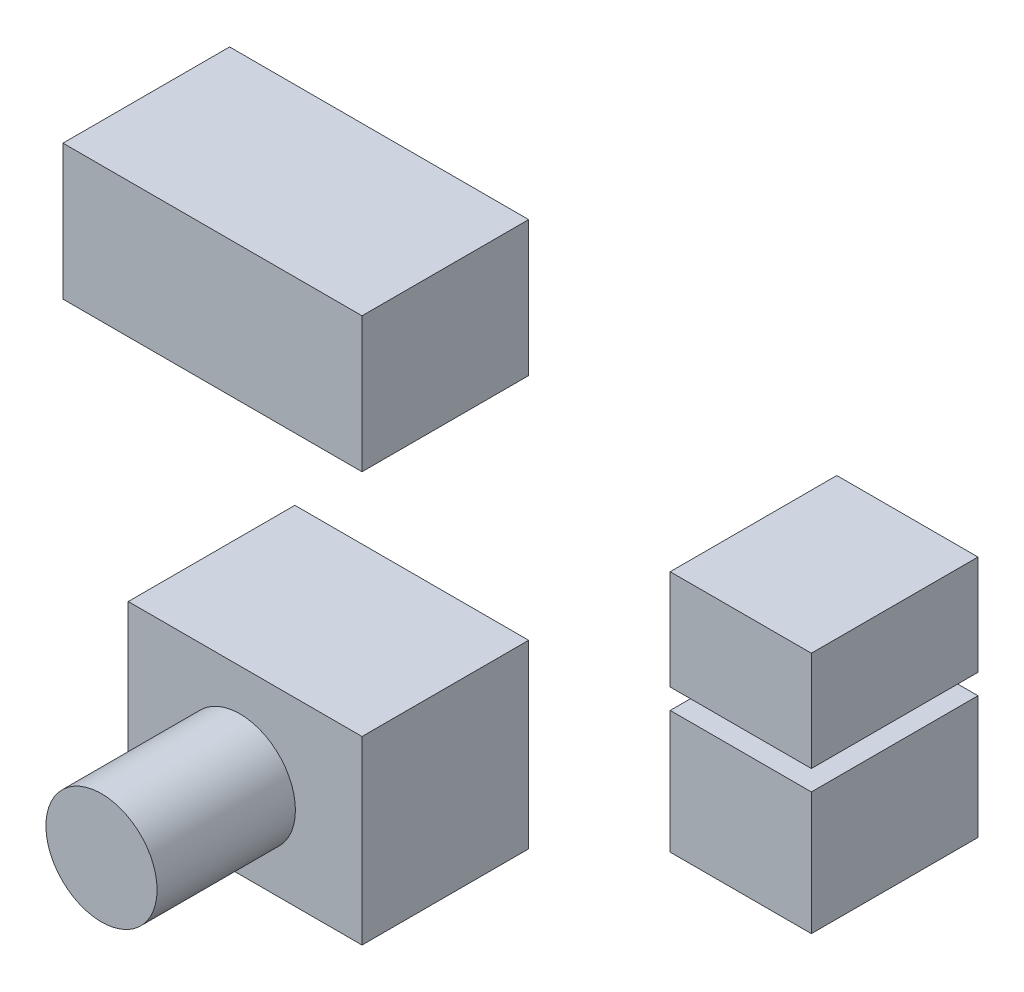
ISO-10303-21;
HEADER;
FILE_DESCRIPTION(('STEP AP214'),'2;1');
FILE_NAME('part.step','',(''),(''),'','','');
FILE_SCHEMA(('AUTOMOTIVE_DESIGN { 1 0 10303 214 1 1 1 1 }'));
ENDSEC;
DATA;
#1=APPLICATION_CONTEXT('core data for automotive mechanical design processes');
#2=APPLICATION_PROTOCOL_DEFINITION('international standard','automotive_design',2000,#1);
#3=PRODUCT_CONTEXT('',#1,'mechanical');
#4=PRODUCT('Part','Part','',(#3));
#5=PRODUCT_RELATED_PRODUCT_CATEGORY('part','',(#4));
#6=PRODUCT_DEFINITION_FORMATION('','',#4);
#7=PRODUCT_DEFINITION_CONTEXT('part definition',#1,'design');
#8=PRODUCT_DEFINITION('design','',#6,#7);
#9=PRODUCT_DEFINITION_SHAPE('','',#8);
#10=(LENGTH_UNIT() NAMED_UNIT(*) SI_UNIT(.MILLI.,.METRE.));
#11=(NAMED_UNIT(*) PLANE_ANGLE_UNIT() SI_UNIT($,.RADIAN.));
#12=(NAMED_UNIT(*) SI_UNIT($,.STERADIAN.) SOLID_ANGLE_UNIT());
#13=UNCERTAINTY_MEASURE_WITH_UNIT(LENGTH_MEASURE(1.E-05),#10,'distance_accuracy_value','');
#14=(GEOMETRIC_REPRESENTATION_CONTEXT(3) GLOBAL_UNCERTAINTY_ASSIGNED_CONTEXT((#13)) GLOBAL_UNIT_ASSIGNED_CONTEXT((#10,
#11,#12)) REPRESENTATION_CONTEXT('',''));
#15=CARTESIAN_POINT('',(0.,0.,0.));
#16=DIRECTION('',(0.,0.,1.));
#17=DIRECTION('',(1.,0.,0.));
#18=AXIS2_PLACEMENT_3D('',#15,#16,#17);
#19=CARTESIAN_POINT('',(27.2263777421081,39.2452291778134,26.924));
#20=DIRECTION('',(1.,0.,0.));
#21=DIRECTION('',(0.,0.,-1.));
#22=AXIS2_PLACEMENT_3D('',#19,#20,#21);
#23=PLANE('',#22);
#24=DIRECTION('',(0.,-1.,0.));
#25=VECTOR('',#24,1.);
#26=CARTESIAN_POINT('',(27.2263777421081,39.2452291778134,0.));
#27=LINE('',#26,#25);
#28=CARTESIAN_POINT('',(27.2263777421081,39.2452291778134,0.));
#29=VERTEX_POINT('',#28);
#30=CARTESIAN_POINT('',(27.2263777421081,23.1094252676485,0.));
#31=VERTEX_POINT('',#30);
#32=EDGE_CURVE('E38',#29,#31,#27,.T.);
#33=ORIENTED_EDGE('',*,*,#32,.T.);
#34=DIRECTION('',(0.,0.,1.));
#35=VECTOR('',#34,1.);
#36=CARTESIAN_POINT('',(27.2263777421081,23.1094252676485,26.924));
#37=LINE('',#36,#35);
#38=CARTESIAN_POINT('',(27.2263777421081,23.1094252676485,26.924));
#39=VERTEX_POINT('',#38);
#40=EDGE_CURVE('E52',#31,#39,#37,.T.);
#41=ORIENTED_EDGE('',*,*,#40,.T.);
#42=DIRECTION('',(0.,-1.,0.));
#43=VECTOR('',#42,1.);
#44=CARTESIAN_POINT('',(27.2263777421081,39.2452291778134,26.924));
#45=LINE('',#44,#43);
#46=CARTESIAN_POINT('',(27.2263777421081,39.2452291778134,26.924));
#47=VERTEX_POINT('',#46);
#48=EDGE_CURVE('E86',#47,#39,#45,.T.);
#49=ORIENTED_EDGE('',*,*,#48,.F.);
#50=DIRECTION('',(0.,0.,-1.));
#51=VECTOR('',#50,1.);
#52=CARTESIAN_POINT('',(27.2263777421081,39.2452291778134,26.924));
#53=LINE('',#52,#51);
#54=EDGE_CURVE('E78',#47,#29,#53,.T.);
#55=ORIENTED_EDGE('',*,*,#54,.T.);
#56=EDGE_LOOP('',(#33,#41,#49,#55));
#57=FACE_BOUND('',#56,.T.);
#58=ADVANCED_FACE('F35',(#57),#23,.F.);
#59=CARTESIAN_POINT('',(50.0376672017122,39.2452291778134,26.924));
#60=DIRECTION('',(-1.,0.,0.));
#61=DIRECTION('',(0.,0.,1.));
#62=AXIS2_PLACEMENT_3D('',#59,#60,#61);
#63=PLANE('',#62);
#64=DIRECTION('',(0.,1.,0.));
#65=VECTOR('',#64,1.);
#66=CARTESIAN_POINT('',(50.0376672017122,39.2452291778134,26.924));
#67=LINE('',#66,#65);
#68=CARTESIAN_POINT('',(50.0376672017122,23.1094252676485,26.924));
#69=VERTEX_POINT('',#68);
#70=CARTESIAN_POINT('',(50.0376672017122,39.2452291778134,26.924));
#71=VERTEX_POINT('',#70);
#72=EDGE_CURVE('E83',#69,#71,#67,.T.);
#73=ORIENTED_EDGE('',*,*,#72,.F.);
#74=DIRECTION('',(0.,0.,-1.));
#75=VECTOR('',#74,1.);
#76=CARTESIAN_POINT('',(50.0376672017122,23.1094252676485,26.924));
#77=LINE('',#76,#75);
#78=CARTESIAN_POINT('',(50.0376672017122,23.1094252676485,0.));
#79=VERTEX_POINT('',#78);
#80=EDGE_CURVE('E71',#69,#79,#77,.T.);
#81=ORIENTED_EDGE('',*,*,#80,.T.);
#82=DIRECTION('',(0.,1.,0.));
#83=VECTOR('',#82,1.);
#84=CARTESIAN_POINT('',(50.0376672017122,39.2452291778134,0.));
#85=LINE('',#84,#83);
#86=CARTESIAN_POINT('',(50.0376672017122,39.2452291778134,0.));
#87=VERTEX_POINT('',#86);
#88=EDGE_CURVE('E77',#79,#87,#85,.T.);
#89=ORIENTED_EDGE('',*,*,#88,.T.);
#90=DIRECTION('',(0.,0.,-1.));
#91=VECTOR('',#90,1.);
#92=CARTESIAN_POINT('',(50.0376672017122,39.2452291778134,26.924));
#93=LINE('',#92,#91);
#94=EDGE_CURVE('E44',#71,#87,#93,.T.);
#95=ORIENTED_EDGE('',*,*,#94,.F.);
#96=EDGE_LOOP('',(#73,#81,#89,#95));
#97=FACE_BOUND('',#96,.T.);
#98=ADVANCED_FACE('F87',(#97),#63,.F.);
#99=CARTESIAN_POINT('',(27.2263777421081,0.,26.924));
#100=DIRECTION('',(0.,0.,1.));
#101=DIRECTION('',(1.,0.,0.));
#102=AXIS2_PLACEMENT_3D('',#99,#100,#101);
#103=PLANE('',#102);
#104=DIRECTION('',(-1.,0.,0.));
#105=VECTOR('',#104,1.);
#106=CARTESIAN_POINT('',(22.8437955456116,23.1094252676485,26.924));
#107=LINE('',#106,#105);
#108=EDGE_CURVE('E12',#69,#39,#107,.T.);
#109=ORIENTED_EDGE('',*,*,#108,.F.);
#110=ORIENTED_EDGE('',*,*,#72,.T.);
#111=DIRECTION('',(-1.,0.,0.));
#112=VECTOR('',#111,1.);
#113=CARTESIAN_POINT('',(27.2263777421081,39.2452291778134,26.924));
#114=LINE('',#113,#112);
#115=EDGE_CURVE('E90',#71,#47,#114,.T.);
#116=ORIENTED_EDGE('',*,*,#115,.T.);
#117=ORIENTED_EDGE('',*,*,#48,.T.);
#118=EDGE_LOOP('',(#109,#110,#116,#117));
#119=FACE_BOUND('',#118,.T.);
#120=ADVANCED_FACE('F82',(#119),#103,.T.);
#121=CARTESIAN_POINT('',(27.2263777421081,0.,0.));
#122=DIRECTION('',(0.,0.,1.));
#123=DIRECTION('',(1.,0.,0.));
#124=AXIS2_PLACEMENT_3D('',#121,#122,#123);
#125=PLANE('',#124);
#126=ORIENTED_EDGE('',*,*,#88,.F.);
#127=DIRECTION('',(-1.,0.,0.));
#128=VECTOR('',#127,1.);
#129=CARTESIAN_POINT('',(27.2263777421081,23.1094252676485,0.));
#130=LINE('',#129,#128);
#131=EDGE_CURVE('E69',#79,#31,#130,.T.);
#132=ORIENTED_EDGE('',*,*,#131,.T.);
#133=ORIENTED_EDGE('',*,*,#32,.F.);
#134=DIRECTION('',(-1.,0.,0.));
#135=VECTOR('',#134,1.);
#136=CARTESIAN_POINT('',(27.2263777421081,39.2452291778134,0.));
#137=LINE('',#136,#135);
#138=EDGE_CURVE('E94',#87,#29,#137,.T.);
#139=ORIENTED_EDGE('',*,*,#138,.F.);
#140=EDGE_LOOP('',(#126,#132,#133,#139));
#141=FACE_BOUND('',#140,.T.);
#142=ADVANCED_FACE('F107',(#141),#125,.F.);
#143=CARTESIAN_POINT('',(27.2263777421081,39.2452291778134,26.924));
#144=DIRECTION('',(0.,-1.,0.));
#145=DIRECTION('',(0.,0.,-1.));
#146=AXIS2_PLACEMENT_3D('',#143,#144,#145);
#147=PLANE('',#146);
#148=ORIENTED_EDGE('',*,*,#138,.T.);
#149=ORIENTED_EDGE('',*,*,#54,.F.);
#150=ORIENTED_EDGE('',*,*,#115,.F.);
#151=ORIENTED_EDGE('',*,*,#94,.T.);
#152=EDGE_LOOP('',(#148,#149,#150,#151));
#153=FACE_BOUND('',#152,.T.);
#154=ADVANCED_FACE('F109',(#153),#147,.F.);
#155=CARTESIAN_POINT('',(22.8437955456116,23.1094252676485,0.));
#156=DIRECTION('',(0.,1.,0.));
#157=DIRECTION('',(0.,0.,1.));
#158=AXIS2_PLACEMENT_3D('',#155,#156,#157);
#159=PLANE('',#158);
#160=ORIENTED_EDGE('',*,*,#131,.F.);
#161=ORIENTED_EDGE('',*,*,#80,.F.);
#162=ORIENTED_EDGE('',*,*,#108,.T.);
#163=ORIENTED_EDGE('',*,*,#40,.F.);
#164=EDGE_LOOP('',(#160,#161,#162,#163));
#165=FACE_BOUND('',#164,.T.);
#166=ADVANCED_FACE('F73',(#165),#159,.F.);
#167=CLOSED_SHELL('',(#58,#98,#120,#142,#154,#166));
#168=MANIFOLD_SOLID_BREP('B2',#167);
#169=CARTESIAN_POINT('',(-42.3098282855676,-24.3837999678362,49.276));
#170=DIRECTION('',(0.,0.,-1.));
#171=DIRECTION('',(-1.,0.,0.));
#172=AXIS2_PLACEMENT_3D('',#169,#170,#171);
#173=CYLINDRICAL_SURFACE('',#172,8.98247136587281);
#174=CARTESIAN_POINT('',(-42.3098282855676,-24.3837999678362,49.276));
#175=DIRECTION('',(0.,0.,1.));
#176=DIRECTION('',(1.,0.,0.));
#177=AXIS2_PLACEMENT_3D('',#174,#175,#176);
#178=CIRCLE('',#177,8.98247136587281);
#179=CARTESIAN_POINT('',(-33.3273569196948,-24.3837999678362,49.276));
#180=VERTEX_POINT('',#179);
#181=EDGE_CURVE('E34',#180,#180,#178,.T.);
#182=ORIENTED_EDGE('',*,*,#181,.F.);
#183=EDGE_LOOP('',(#182));
#184=FACE_BOUND('',#183,.T.);
#185=CARTESIAN_POINT('',(-42.3098282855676,-24.3837999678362,26.924));
#186=DIRECTION('',(0.,0.,1.));
#187=DIRECTION('',(1.,0.,0.));
#188=AXIS2_PLACEMENT_3D('',#185,#186,#187);
#189=CIRCLE('',#188,8.98247136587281);
#190=CARTESIAN_POINT('',(-33.3273569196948,-24.3837999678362,26.924));
#191=VERTEX_POINT('',#190);
#192=EDGE_CURVE('E162',#191,#191,#189,.T.);
#193=ORIENTED_EDGE('',*,*,#192,.T.);
#194=EDGE_LOOP('',(#193));
#195=FACE_BOUND('',#194,.T.);
#196=ADVANCED_FACE('F156',(#184,#195),#173,.T.);
#197=CARTESIAN_POINT('',(-42.3098282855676,-24.3837999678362,49.276));
#198=DIRECTION('',(0.,0.,1.));
#199=DIRECTION('',(1.,0.,0.));
#200=AXIS2_PLACEMENT_3D('',#197,#198,#199);
#201=PLANE('',#200);
#202=ORIENTED_EDGE('',*,*,#181,.T.);
#203=EDGE_LOOP('',(#202));
#204=FACE_BOUND('',#203,.T.);
#205=ADVANCED_FACE('F171',(#204),#201,.T.);
#206=CARTESIAN_POINT('',(-42.3098282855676,-24.3837999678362,26.924));
#207=DIRECTION('',(0.,0.,1.));
#208=DIRECTION('',(1.,0.,0.));
#209=AXIS2_PLACEMENT_3D('',#206,#207,#208);
#210=PLANE('',#209);
#211=ORIENTED_EDGE('',*,*,#192,.F.);
#212=EDGE_LOOP('',(#211));
#213=FACE_BOUND('',#212,.T.);
#214=ADVANCED_FACE('F169',(#213),#210,.F.);
#215=CLOSED_SHELL('',(#196,#205,#214));
#216=MANIFOLD_SOLID_BREP('B6',#215);
#217=CARTESIAN_POINT('',(-60.3395398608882,-8.70753522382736,26.924));
#218=DIRECTION('',(1.,0.,0.));
#219=DIRECTION('',(0.,0.,-1.));
#220=AXIS2_PLACEMENT_3D('',#217,#218,#219);
#221=PLANE('',#220);
#222=DIRECTION('',(0.,-1.,0.));
#223=VECTOR('',#222,1.);
#224=CARTESIAN_POINT('',(-60.3395398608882,-8.70753522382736,0.));
#225=LINE('',#224,#223);
#226=CARTESIAN_POINT('',(-60.3395398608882,-8.70753522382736,0.));
#227=VERTEX_POINT('',#226);
#228=CARTESIAN_POINT('',(-60.3395398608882,-37.8961744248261,0.));
#229=VERTEX_POINT('',#228);
#230=EDGE_CURVE('E244',#227,#229,#225,.T.);
#231=ORIENTED_EDGE('',*,*,#230,.T.);
#232=DIRECTION('',(0.,0.,-1.));
#233=VECTOR('',#232,1.);
#234=CARTESIAN_POINT('',(-60.3395398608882,-37.8961744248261,26.924));
#235=LINE('',#234,#233);
#236=CARTESIAN_POINT('',(-60.3395398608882,-37.8961744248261,26.924));
#237=VERTEX_POINT('',#236);
#238=EDGE_CURVE('E154',#237,#229,#235,.T.);
#239=ORIENTED_EDGE('',*,*,#238,.F.);
#240=DIRECTION('',(0.,-1.,0.));
#241=VECTOR('',#240,1.);
#242=CARTESIAN_POINT('',(-60.3395398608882,-8.70753522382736,26.924));
#243=LINE('',#242,#241);
#244=CARTESIAN_POINT('',(-60.3395398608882,-8.70753522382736,26.924));
#245=VERTEX_POINT('',#244);
#246=EDGE_CURVE('E262',#245,#237,#243,.T.);
#247=ORIENTED_EDGE('',*,*,#246,.F.);
#248=DIRECTION('',(0.,0.,-1.));
#249=VECTOR('',#248,1.);
#250=CARTESIAN_POINT('',(-60.3395398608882,-8.70753522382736,26.924));
#251=LINE('',#250,#249);
#252=EDGE_CURVE('E256',#245,#227,#251,.T.);
#253=ORIENTED_EDGE('',*,*,#252,.T.);
#254=EDGE_LOOP('',(#231,#239,#247,#253));
#255=FACE_BOUND('',#254,.T.);
#256=ADVANCED_FACE('F200',(#255),#221,.F.);
#257=CARTESIAN_POINT('',(-60.3395398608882,-37.8961744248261,26.924));
#258=DIRECTION('',(0.,1.,0.));
#259=DIRECTION('',(0.,0.,1.));
#260=AXIS2_PLACEMENT_3D('',#257,#258,#259);
#261=PLANE('',#260);
#262=DIRECTION('',(1.,0.,0.));
#263=VECTOR('',#262,1.);
#264=CARTESIAN_POINT('',(-60.3395398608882,-37.8961744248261,0.));
#265=LINE('',#264,#263);
#266=CARTESIAN_POINT('',(-22.5660067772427,-37.8961744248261,0.));
#267=VERTEX_POINT('',#266);
#268=EDGE_CURVE('E240',#229,#267,#265,.T.);
#269=ORIENTED_EDGE('',*,*,#268,.T.);
#270=DIRECTION('',(0.,0.,-1.));
#271=VECTOR('',#270,1.);
#272=CARTESIAN_POINT('',(-22.5660067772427,-37.8961744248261,26.924));
#273=LINE('',#272,#271);
#274=CARTESIAN_POINT('',(-22.5660067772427,-37.8961744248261,26.924));
#275=VERTEX_POINT('',#274);
#276=EDGE_CURVE('E207',#275,#267,#273,.T.);
#277=ORIENTED_EDGE('',*,*,#276,.F.);
#278=DIRECTION('',(1.,0.,0.));
#279=VECTOR('',#278,1.);
#280=CARTESIAN_POINT('',(-60.3395398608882,-37.8961744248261,26.924));
#281=LINE('',#280,#279);
#282=EDGE_CURVE('E252',#237,#275,#281,.T.);
#283=ORIENTED_EDGE('',*,*,#282,.F.);
#284=ORIENTED_EDGE('',*,*,#238,.T.);
#285=EDGE_LOOP('',(#269,#277,#283,#284));
#286=FACE_BOUND('',#285,.T.);
#287=ADVANCED_FACE('F251',(#286),#261,.F.);
#288=CARTESIAN_POINT('',(-22.5660067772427,-8.70753522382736,26.924));
#289=DIRECTION('',(-1.,0.,0.));
#290=DIRECTION('',(0.,0.,1.));
#291=AXIS2_PLACEMENT_3D('',#288,#289,#290);
#292=PLANE('',#291);
#293=DIRECTION('',(0.,1.,0.));
#294=VECTOR('',#293,1.);
#295=CARTESIAN_POINT('',(-22.5660067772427,-8.70753522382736,0.));
#296=LINE('',#295,#294);
#297=CARTESIAN_POINT('',(-22.5660067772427,-8.70753522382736,0.));
#298=VERTEX_POINT('',#297);
#299=EDGE_CURVE('E245',#267,#298,#296,.T.);
#300=ORIENTED_EDGE('',*,*,#299,.T.);
#301=DIRECTION('',(0.,0.,-1.));
#302=VECTOR('',#301,1.);
#303=CARTESIAN_POINT('',(-22.5660067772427,-8.70753522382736,26.924));
#304=LINE('',#303,#302);
#305=CARTESIAN_POINT('',(-22.5660067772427,-8.70753522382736,26.924));
#306=VERTEX_POINT('',#305);
#307=EDGE_CURVE('E268',#306,#298,#304,.T.);
#308=ORIENTED_EDGE('',*,*,#307,.F.);
#309=DIRECTION('',(0.,1.,0.));
#310=VECTOR('',#309,1.);
#311=CARTESIAN_POINT('',(-22.5660067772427,-8.70753522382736,26.924));
#312=LINE('',#311,#310);
#313=EDGE_CURVE('E219',#275,#306,#312,.T.);
#314=ORIENTED_EDGE('',*,*,#313,.F.);
#315=ORIENTED_EDGE('',*,*,#276,.T.);
#316=EDGE_LOOP('',(#300,#308,#314,#315));
#317=FACE_BOUND('',#316,.T.);
#318=ADVANCED_FACE('F271',(#317),#292,.F.);
#319=CARTESIAN_POINT('',(-60.3395398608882,-8.70753522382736,26.924));
#320=DIRECTION('',(0.,-1.,0.));
#321=DIRECTION('',(0.,0.,-1.));
#322=AXIS2_PLACEMENT_3D('',#319,#320,#321);
#323=PLANE('',#322);
#324=DIRECTION('',(-1.,0.,0.));
#325=VECTOR('',#324,1.);
#326=CARTESIAN_POINT('',(-60.3395398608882,-8.70753522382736,0.));
#327=LINE('',#326,#325);
#328=EDGE_CURVE('E260',#298,#227,#327,.T.);
#329=ORIENTED_EDGE('',*,*,#328,.T.);
#330=ORIENTED_EDGE('',*,*,#252,.F.);
#331=DIRECTION('',(-1.,0.,0.));
#332=VECTOR('',#331,1.);
#333=CARTESIAN_POINT('',(-60.3395398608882,-8.70753522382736,26.924));
#334=LINE('',#333,#332);
#335=EDGE_CURVE('E214',#306,#245,#334,.T.);
#336=ORIENTED_EDGE('',*,*,#335,.F.);
#337=ORIENTED_EDGE('',*,*,#307,.T.);
#338=EDGE_LOOP('',(#329,#330,#336,#337));
#339=FACE_BOUND('',#338,.T.);
#340=ADVANCED_FACE('F273',(#339),#323,.F.);
#341=CARTESIAN_POINT('',(-60.3395398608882,-37.8961744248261,26.924));
#342=DIRECTION('',(0.,0.,1.));
#343=DIRECTION('',(1.,0.,0.));
#344=AXIS2_PLACEMENT_3D('',#341,#342,#343);
#345=PLANE('',#344);
#346=ORIENTED_EDGE('',*,*,#246,.T.);
#347=ORIENTED_EDGE('',*,*,#282,.T.);
#348=ORIENTED_EDGE('',*,*,#313,.T.);
#349=ORIENTED_EDGE('',*,*,#335,.T.);
#350=EDGE_LOOP('',(#346,#347,#348,#349));
#351=FACE_BOUND('',#350,.T.);
#352=ADVANCED_FACE('F274',(#351),#345,.T.);
#353=CARTESIAN_POINT('',(-60.3395398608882,-37.8961744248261,0.));
#354=DIRECTION('',(0.,0.,1.));
#355=DIRECTION('',(1.,0.,0.));
#356=AXIS2_PLACEMENT_3D('',#353,#354,#355);
#357=PLANE('',#356);
#358=ORIENTED_EDGE('',*,*,#230,.F.);
#359=ORIENTED_EDGE('',*,*,#328,.F.);
#360=ORIENTED_EDGE('',*,*,#299,.F.);
#361=ORIENTED_EDGE('',*,*,#268,.F.);
#362=EDGE_LOOP('',(#358,#359,#360,#361));
#363=FACE_BOUND('',#362,.T.);
#364=ADVANCED_FACE('F241',(#363),#357,.F.);
#365=CLOSED_SHELL('',(#256,#287,#318,#340,#352,#364));
#366=MANIFOLD_SOLID_BREP('B29',#365);
#367=CARTESIAN_POINT('',(27.2263777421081,0.,26.924));
#368=DIRECTION('',(0.,1.,0.));
#369=DIRECTION('',(0.,0.,1.));
#370=AXIS2_PLACEMENT_3D('',#367,#368,#369);
#371=PLANE('',#370);
#372=DIRECTION('',(1.,0.,0.));
#373=VECTOR('',#372,1.);
#374=CARTESIAN_POINT('',(27.2263777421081,0.,0.));
#375=LINE('',#374,#373);
#376=CARTESIAN_POINT('',(27.2263777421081,0.,0.));
#377=VERTEX_POINT('',#376);
#378=CARTESIAN_POINT('',(50.0376672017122,0.,0.));
#379=VERTEX_POINT('',#378);
#380=EDGE_CURVE('E380',#377,#379,#375,.T.);
#381=ORIENTED_EDGE('',*,*,#380,.T.);
#382=DIRECTION('',(0.,0.,-1.));
#383=VECTOR('',#382,1.);
#384=CARTESIAN_POINT('',(50.0376672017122,0.,26.924));
#385=LINE('',#384,#383);
#386=CARTESIAN_POINT('',(50.0376672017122,0.,26.924));
#387=VERTEX_POINT('',#386);
#388=EDGE_CURVE('E385',#387,#379,#385,.T.);
#389=ORIENTED_EDGE('',*,*,#388,.F.);
#390=DIRECTION('',(1.,0.,0.));
#391=VECTOR('',#390,1.);
#392=CARTESIAN_POINT('',(27.2263777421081,0.,26.924));
#393=LINE('',#392,#391);
#394=CARTESIAN_POINT('',(27.2263777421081,0.,26.924));
#395=VERTEX_POINT('',#394);
#396=EDGE_CURVE('E343',#395,#387,#393,.T.);
#397=ORIENTED_EDGE('',*,*,#396,.F.);
#398=DIRECTION('',(0.,0.,-1.));
#399=VECTOR('',#398,1.);
#400=CARTESIAN_POINT('',(27.2263777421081,0.,26.924));
#401=LINE('',#400,#399);
#402=EDGE_CURVE('E329',#395,#377,#401,.T.);
#403=ORIENTED_EDGE('',*,*,#402,.T.);
#404=EDGE_LOOP('',(#381,#389,#397,#403));
#405=FACE_BOUND('',#404,.T.);
#406=ADVANCED_FACE('F321',(#405),#371,.F.);
#407=CARTESIAN_POINT('',(27.2263777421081,0.,26.924));
#408=DIRECTION('',(0.,0.,1.));
#409=DIRECTION('',(1.,0.,0.));
#410=AXIS2_PLACEMENT_3D('',#407,#408,#409);
#411=PLANE('',#410);
#412=DIRECTION('',(1.,0.,0.));
#413=VECTOR('',#412,1.);
#414=CARTESIAN_POINT('',(22.8437955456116,19.8367738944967,26.924));
#415=LINE('',#414,#413);
#416=CARTESIAN_POINT('',(27.2263777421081,19.8367738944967,26.924));
#417=VERTEX_POINT('',#416);
#418=CARTESIAN_POINT('',(50.0376672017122,19.8367738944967,26.924));
#419=VERTEX_POINT('',#418);
#420=EDGE_CURVE('E363',#417,#419,#415,.T.);
#421=ORIENTED_EDGE('',*,*,#420,.F.);
#422=DIRECTION('',(0.,-1.,0.));
#423=VECTOR('',#422,1.);
#424=CARTESIAN_POINT('',(27.2263777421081,39.2452291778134,26.924));
#425=LINE('',#424,#423);
#426=EDGE_CURVE('E370',#417,#395,#425,.T.);
#427=ORIENTED_EDGE('',*,*,#426,.T.);
#428=ORIENTED_EDGE('',*,*,#396,.T.);
#429=DIRECTION('',(0.,1.,0.));
#430=VECTOR('',#429,1.);
#431=CARTESIAN_POINT('',(50.0376672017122,39.2452291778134,26.924));
#432=LINE('',#431,#430);
#433=EDGE_CURVE('E372',#387,#419,#432,.T.);
#434=ORIENTED_EDGE('',*,*,#433,.T.);
#435=EDGE_LOOP('',(#421,#427,#428,#434));
#436=FACE_BOUND('',#435,.T.);
#437=ADVANCED_FACE('F369',(#436),#411,.T.);
#438=CARTESIAN_POINT('',(27.2263777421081,0.,0.));
#439=DIRECTION('',(0.,0.,1.));
#440=DIRECTION('',(1.,0.,0.));
#441=AXIS2_PLACEMENT_3D('',#438,#439,#440);
#442=PLANE('',#441);
#443=DIRECTION('',(0.,-1.,0.));
#444=VECTOR('',#443,1.);
#445=CARTESIAN_POINT('',(27.2263777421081,39.2452291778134,0.));
#446=LINE('',#445,#444);
#447=CARTESIAN_POINT('',(27.2263777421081,19.8367738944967,0.));
#448=VERTEX_POINT('',#447);
#449=EDGE_CURVE('E367',#448,#377,#446,.T.);
#450=ORIENTED_EDGE('',*,*,#449,.F.);
#451=DIRECTION('',(1.,0.,0.));
#452=VECTOR('',#451,1.);
#453=CARTESIAN_POINT('',(27.2263777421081,19.8367738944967,0.));
#454=LINE('',#453,#452);
#455=CARTESIAN_POINT('',(50.0376672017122,19.8367738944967,0.));
#456=VERTEX_POINT('',#455);
#457=EDGE_CURVE('E198',#448,#456,#454,.T.);
#458=ORIENTED_EDGE('',*,*,#457,.T.);
#459=DIRECTION('',(0.,1.,0.));
#460=VECTOR('',#459,1.);
#461=CARTESIAN_POINT('',(50.0376672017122,39.2452291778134,0.));
#462=LINE('',#461,#460);
#463=EDGE_CURVE('E376',#379,#456,#462,.T.);
#464=ORIENTED_EDGE('',*,*,#463,.F.);
#465=ORIENTED_EDGE('',*,*,#380,.F.);
#466=EDGE_LOOP('',(#450,#458,#464,#465));
#467=FACE_BOUND('',#466,.T.);
#468=ADVANCED_FACE('F395',(#467),#442,.F.);
#469=CARTESIAN_POINT('',(50.0376672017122,39.2452291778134,26.924));
#470=DIRECTION('',(-1.,0.,0.));
#471=DIRECTION('',(0.,0.,1.));
#472=AXIS2_PLACEMENT_3D('',#469,#470,#471);
#473=PLANE('',#472);
#474=ORIENTED_EDGE('',*,*,#463,.T.);
#475=DIRECTION('',(0.,0.,1.));
#476=VECTOR('',#475,1.);
#477=CARTESIAN_POINT('',(50.0376672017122,19.8367738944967,26.924));
#478=LINE('',#477,#476);
#479=EDGE_CURVE('E336',#456,#419,#478,.T.);
#480=ORIENTED_EDGE('',*,*,#479,.T.);
#481=ORIENTED_EDGE('',*,*,#433,.F.);
#482=ORIENTED_EDGE('',*,*,#388,.T.);
#483=EDGE_LOOP('',(#474,#480,#481,#482));
#484=FACE_BOUND('',#483,.T.);
#485=ADVANCED_FACE('F391',(#484),#473,.F.);
#486=CARTESIAN_POINT('',(27.2263777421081,39.2452291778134,26.924));
#487=DIRECTION('',(1.,0.,0.));
#488=DIRECTION('',(0.,0.,-1.));
#489=AXIS2_PLACEMENT_3D('',#486,#487,#488);
#490=PLANE('',#489);
#491=ORIENTED_EDGE('',*,*,#426,.F.);
#492=DIRECTION('',(0.,0.,-1.));
#493=VECTOR('',#492,1.);
#494=CARTESIAN_POINT('',(27.2263777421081,19.8367738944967,26.924));
#495=LINE('',#494,#493);
#496=EDGE_CURVE('E360',#417,#448,#495,.T.);
#497=ORIENTED_EDGE('',*,*,#496,.T.);
#498=ORIENTED_EDGE('',*,*,#449,.T.);
#499=ORIENTED_EDGE('',*,*,#402,.F.);
#500=EDGE_LOOP('',(#491,#497,#498,#499));
#501=FACE_BOUND('',#500,.T.);
#502=ADVANCED_FACE('F323',(#501),#490,.F.);
#503=CARTESIAN_POINT('',(22.8437955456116,19.8367738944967,0.));
#504=DIRECTION('',(0.,-1.,0.));
#505=DIRECTION('',(0.,0.,-1.));
#506=AXIS2_PLACEMENT_3D('',#503,#504,#505);
#507=PLANE('',#506);
#508=ORIENTED_EDGE('',*,*,#420,.T.);
#509=ORIENTED_EDGE('',*,*,#479,.F.);
#510=ORIENTED_EDGE('',*,*,#457,.F.);
#511=ORIENTED_EDGE('',*,*,#496,.F.);
#512=EDGE_LOOP('',(#508,#509,#510,#511));
#513=FACE_BOUND('',#512,.T.);
#514=ADVANCED_FACE('F362',(#513),#507,.F.);
#515=CLOSED_SHELL('',(#406,#437,#468,#485,#502,#514));
#516=MANIFOLD_SOLID_BREP('B148',#515);
#517=CARTESIAN_POINT('',(-70.8866952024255,50.1603085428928,26.924));
#518=DIRECTION('',(1.,0.,0.));
#519=DIRECTION('',(0.,0.,-1.));
#520=AXIS2_PLACEMENT_3D('',#517,#518,#519);
#521=PLANE('',#520);
#522=DIRECTION('',(0.,-1.,0.));
#523=VECTOR('',#522,1.);
#524=CARTESIAN_POINT('',(-70.8866952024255,50.1603085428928,0.));
#525=LINE('',#524,#523);
#526=CARTESIAN_POINT('',(-70.8866952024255,50.1603085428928,0.));
#527=VERTEX_POINT('',#526);
#528=CARTESIAN_POINT('',(-70.8866952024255,28.3301498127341,0.));
#529=VERTEX_POINT('',#528);
#530=EDGE_CURVE('E476',#527,#529,#525,.T.);
#531=ORIENTED_EDGE('',*,*,#530,.T.);
#532=DIRECTION('',(0.,0.,-1.));
#533=VECTOR('',#532,1.);
#534=CARTESIAN_POINT('',(-70.8866952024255,28.3301498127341,26.924));
#535=LINE('',#534,#533);
#536=CARTESIAN_POINT('',(-70.8866952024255,28.3301498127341,26.924));
#537=VERTEX_POINT('',#536);
#538=EDGE_CURVE('E319',#537,#529,#535,.T.);
#539=ORIENTED_EDGE('',*,*,#538,.F.);
#540=DIRECTION('',(0.,-1.,0.));
#541=VECTOR('',#540,1.);
#542=CARTESIAN_POINT('',(-70.8866952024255,50.1603085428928,26.924));
#543=LINE('',#542,#541);
#544=CARTESIAN_POINT('',(-70.8866952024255,50.1603085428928,26.924));
#545=VERTEX_POINT('',#544);
#546=EDGE_CURVE('E494',#545,#537,#543,.T.);
#547=ORIENTED_EDGE('',*,*,#546,.F.);
#548=DIRECTION('',(0.,0.,-1.));
#549=VECTOR('',#548,1.);
#550=CARTESIAN_POINT('',(-70.8866952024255,50.1603085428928,26.924));
#551=LINE('',#550,#549);
#552=EDGE_CURVE('E488',#545,#527,#551,.T.);
#553=ORIENTED_EDGE('',*,*,#552,.T.);
#554=EDGE_LOOP('',(#531,#539,#547,#553));
#555=FACE_BOUND('',#554,.T.);
#556=ADVANCED_FACE('F432',(#555),#521,.F.);
#557=CARTESIAN_POINT('',(-70.8866952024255,28.3301498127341,26.924));
#558=DIRECTION('',(0.,1.,0.));
#559=DIRECTION('',(0.,0.,1.));
#560=AXIS2_PLACEMENT_3D('',#557,#558,#559);
#561=PLANE('',#560);
#562=DIRECTION('',(1.,0.,0.));
#563=VECTOR('',#562,1.);
#564=CARTESIAN_POINT('',(-70.8866952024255,28.3301498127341,0.));
#565=LINE('',#564,#563);
#566=CARTESIAN_POINT('',(-22.5660067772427,28.3301498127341,0.));
#567=VERTEX_POINT('',#566);
#568=EDGE_CURVE('E472',#529,#567,#565,.T.);
#569=ORIENTED_EDGE('',*,*,#568,.T.);
#570=DIRECTION('',(0.,0.,-1.));
#571=VECTOR('',#570,1.);
#572=CARTESIAN_POINT('',(-22.5660067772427,28.3301498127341,26.924));
#573=LINE('',#572,#571);
#574=CARTESIAN_POINT('',(-22.5660067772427,28.3301498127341,26.924));
#575=VERTEX_POINT('',#574);
#576=EDGE_CURVE('E439',#575,#567,#573,.T.);
#577=ORIENTED_EDGE('',*,*,#576,.F.);
#578=DIRECTION('',(1.,0.,0.));
#579=VECTOR('',#578,1.);
#580=CARTESIAN_POINT('',(-70.8866952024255,28.3301498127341,26.924));
#581=LINE('',#580,#579);
#582=EDGE_CURVE('E484',#537,#575,#581,.T.);
#583=ORIENTED_EDGE('',*,*,#582,.F.);
#584=ORIENTED_EDGE('',*,*,#538,.T.);
#585=EDGE_LOOP('',(#569,#577,#583,#584));
#586=FACE_BOUND('',#585,.T.);
#587=ADVANCED_FACE('F483',(#586),#561,.F.);
#588=CARTESIAN_POINT('',(-22.5660067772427,50.1603085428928,26.924));
#589=DIRECTION('',(-1.,0.,0.));
#590=DIRECTION('',(0.,0.,1.));
#591=AXIS2_PLACEMENT_3D('',#588,#589,#590);
#592=PLANE('',#591);
#593=DIRECTION('',(0.,1.,0.));
#594=VECTOR('',#593,1.);
#595=CARTESIAN_POINT('',(-22.5660067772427,50.1603085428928,0.));
#596=LINE('',#595,#594);
#597=CARTESIAN_POINT('',(-22.5660067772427,50.1603085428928,0.));
#598=VERTEX_POINT('',#597);
#599=EDGE_CURVE('E477',#567,#598,#596,.T.);
#600=ORIENTED_EDGE('',*,*,#599,.T.);
#601=DIRECTION('',(0.,0.,-1.));
#602=VECTOR('',#601,1.);
#603=CARTESIAN_POINT('',(-22.5660067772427,50.1603085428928,26.924));
#604=LINE('',#603,#602);
#605=CARTESIAN_POINT('',(-22.5660067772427,50.1603085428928,26.924));
#606=VERTEX_POINT('',#605);
#607=EDGE_CURVE('E500',#606,#598,#604,.T.);
#608=ORIENTED_EDGE('',*,*,#607,.F.);
#609=DIRECTION('',(0.,1.,0.));
#610=VECTOR('',#609,1.);
#611=CARTESIAN_POINT('',(-22.5660067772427,50.1603085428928,26.924));
#612=LINE('',#611,#610);
#613=EDGE_CURVE('E451',#575,#606,#612,.T.);
#614=ORIENTED_EDGE('',*,*,#613,.F.);
#615=ORIENTED_EDGE('',*,*,#576,.T.);
#616=EDGE_LOOP('',(#600,#608,#614,#615));
#617=FACE_BOUND('',#616,.T.);
#618=ADVANCED_FACE('F503',(#617),#592,.F.);
#619=CARTESIAN_POINT('',(-70.8866952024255,50.1603085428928,26.924));
#620=DIRECTION('',(0.,-1.,0.));
#621=DIRECTION('',(0.,0.,-1.));
#622=AXIS2_PLACEMENT_3D('',#619,#620,#621);
#623=PLANE('',#622);
#624=DIRECTION('',(-1.,0.,0.));
#625=VECTOR('',#624,1.);
#626=CARTESIAN_POINT('',(-70.8866952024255,50.1603085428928,0.));
#627=LINE('',#626,#625);
#628=EDGE_CURVE('E492',#598,#527,#627,.T.);
#629=ORIENTED_EDGE('',*,*,#628,.T.);
#630=ORIENTED_EDGE('',*,*,#552,.F.);
#631=DIRECTION('',(-1.,0.,0.));
#632=VECTOR('',#631,1.);
#633=CARTESIAN_POINT('',(-70.8866952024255,50.1603085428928,26.924));
#634=LINE('',#633,#632);
#635=EDGE_CURVE('E446',#606,#545,#634,.T.);
#636=ORIENTED_EDGE('',*,*,#635,.F.);
#637=ORIENTED_EDGE('',*,*,#607,.T.);
#638=EDGE_LOOP('',(#629,#630,#636,#637));
#639=FACE_BOUND('',#638,.T.);
#640=ADVANCED_FACE('F505',(#639),#623,.F.);
#641=CARTESIAN_POINT('',(-70.8866952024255,28.3301498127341,26.924));
#642=DIRECTION('',(0.,0.,1.));
#643=DIRECTION('',(1.,0.,0.));
#644=AXIS2_PLACEMENT_3D('',#641,#642,#643);
#645=PLANE('',#644);
#646=ORIENTED_EDGE('',*,*,#546,.T.);
#647=ORIENTED_EDGE('',*,*,#582,.T.);
#648=ORIENTED_EDGE('',*,*,#613,.T.);
#649=ORIENTED_EDGE('',*,*,#635,.T.);
#650=EDGE_LOOP('',(#646,#647,#648,#649));
#651=FACE_BOUND('',#650,.T.);
#652=ADVANCED_FACE('F506',(#651),#645,.T.);
#653=CARTESIAN_POINT('',(-70.8866952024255,28.3301498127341,0.));
#654=DIRECTION('',(0.,0.,1.));
#655=DIRECTION('',(1.,0.,0.));
#656=AXIS2_PLACEMENT_3D('',#653,#654,#655);
#657=PLANE('',#656);
#658=ORIENTED_EDGE('',*,*,#530,.F.);
#659=ORIENTED_EDGE('',*,*,#628,.F.);
#660=ORIENTED_EDGE('',*,*,#599,.F.);
#661=ORIENTED_EDGE('',*,*,#568,.F.);
#662=EDGE_LOOP('',(#658,#659,#660,#661));
#663=FACE_BOUND('',#662,.T.);
#664=ADVANCED_FACE('F473',(#663),#657,.F.);
#665=CLOSED_SHELL('',(#556,#587,#618,#640,#652,#664));
#666=MANIFOLD_SOLID_BREP('B192',#665);
#667=ADVANCED_BREP_SHAPE_REPRESENTATION('',(#18,#168,#216,#366,#516,#666),#14);
#668=SHAPE_DEFINITION_REPRESENTATION(#9,#667);
ENDSEC;
END-ISO-10303-21;
